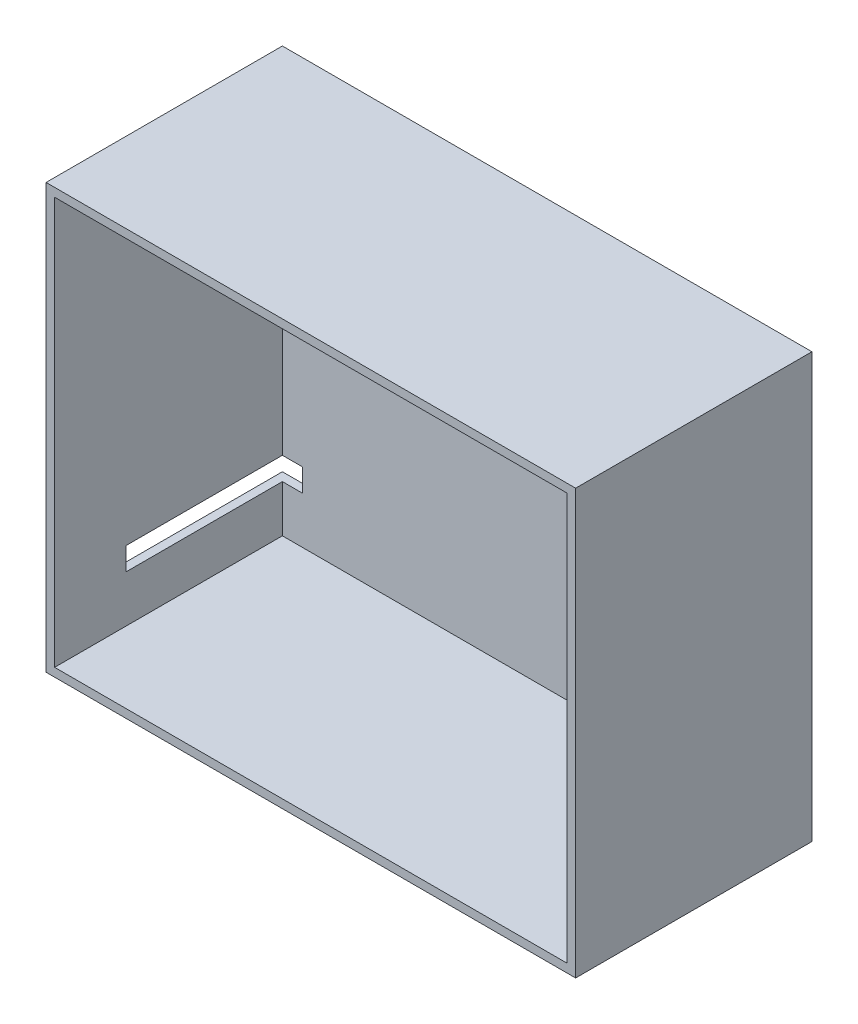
from build123d import *

# Parameters (mm, degrees)
SKETCH_1_W                      = 186
SKETCH_1_H                      = 149
FLOOR_T3_DEPTH                  = 3
SKETCH_2_W                      = 186
SKETCH_2_H                      = 149
SKETCH_2_W_2                    = 180
SKETCH_2_H_2                    = 143
WALLS_T3_DEPTH80_DEPTH          = 83
SKETCH_3_W                      = 11
SKETCH_3_H                      = 8
SERVO_STAND_RELIEF_W8_H58_DEPTH = 58


with BuildPart() as part:
    # Sketch 1 → Floor_T3 (new body)
    with BuildSketch(Plane.XY):
        with Locations((93, 74.5)):
            Rectangle(SKETCH_1_W, SKETCH_1_H)
    extrude(amount=FLOOR_T3_DEPTH)

    # Sketch 2 → Walls_T3_depth80 (add)
    with BuildSketch(Plane.XY):
        with Locations((93, 74.5)):
            Rectangle(SKETCH_2_W, SKETCH_2_H)
        with Locations((93, 74.5)):
            Rectangle(SKETCH_2_W_2, SKETCH_2_H_2, mode=Mode.SUBTRACT)
    extrude(amount=WALLS_T3_DEPTH80_DEPTH)

    # Sketch 3 → Servo_stand_relief_W8_H58 (cut)
    with BuildSketch(Plane.XY):
        with Locations((4.5, 23.5)):
            Rectangle(SKETCH_3_W, SKETCH_3_H)
    extrude(amount=SERVO_STAND_RELIEF_W8_H58_DEPTH, mode=Mode.SUBTRACT)


solid = part.part
